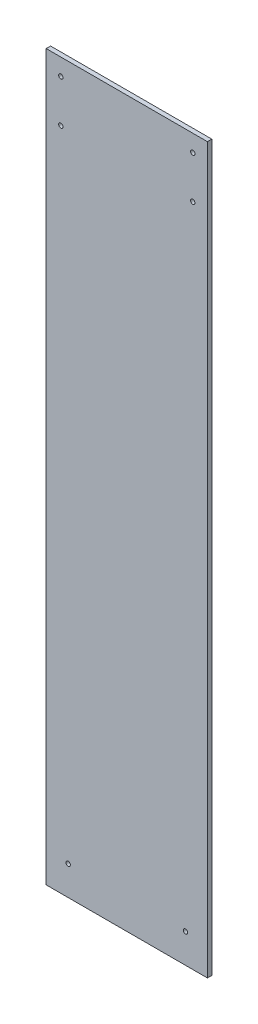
from build123d import *

# Parameters (mm, degrees)
SKETCH1_W           = 110
SKETCH1_H           = 494
SKETCH1_R           = 1.5
BOSS_EXTRUDE1_DEPTH = 3


with BuildPart() as part:
    # Sketch1 → Boss-Extrude1 (new body)
    with BuildSketch(Plane.XY):
        with Locations((0, -7)):
            Rectangle(SKETCH1_W, SKETCH1_H)
        with Locations((45, 228.5)):
            Circle(SKETCH1_R, mode=Mode.SUBTRACT)
        with Locations((45, 199.5)):
            Circle(SKETCH1_R, mode=Mode.SUBTRACT)
        with Locations((-45, 199.5)):
            Circle(SKETCH1_R, mode=Mode.SUBTRACT)
        with Locations((-45, 228.5)):
            Circle(SKETCH1_R, mode=Mode.SUBTRACT)
        with Locations((40, -234)):
            Circle(SKETCH1_R, mode=Mode.SUBTRACT)
        with Locations((-40, -234)):
            Circle(SKETCH1_R, mode=Mode.SUBTRACT)
    extrude(amount=BOSS_EXTRUDE1_DEPTH)


solid = part.part
